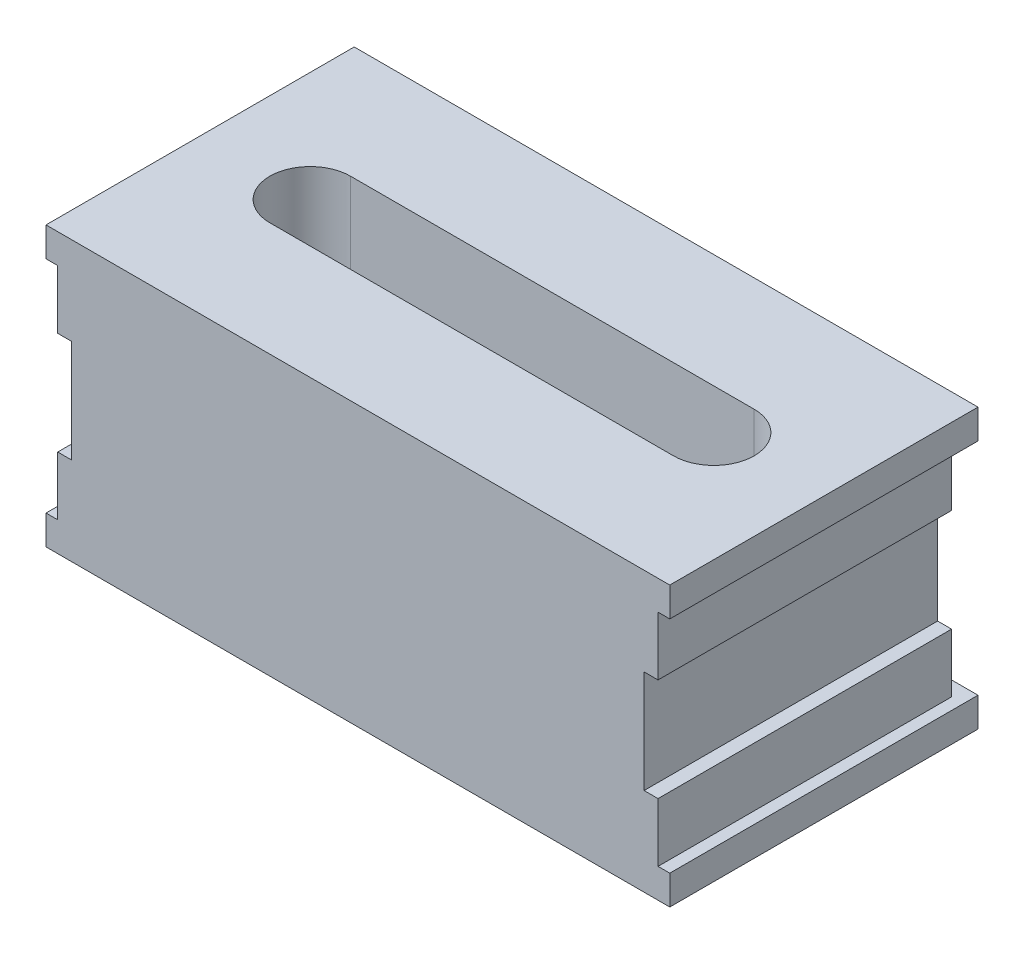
ISO-10303-21;
HEADER;
FILE_DESCRIPTION(('STEP AP214'),'2;1');
FILE_NAME('part.step','',(''),(''),'','','');
FILE_SCHEMA(('AUTOMOTIVE_DESIGN { 1 0 10303 214 1 1 1 1 }'));
ENDSEC;
DATA;
#1=APPLICATION_CONTEXT('core data for automotive mechanical design processes');
#2=APPLICATION_PROTOCOL_DEFINITION('international standard','automotive_design',2000,#1);
#3=PRODUCT_CONTEXT('',#1,'mechanical');
#4=PRODUCT('Part','Part','',(#3));
#5=PRODUCT_RELATED_PRODUCT_CATEGORY('part','',(#4));
#6=PRODUCT_DEFINITION_FORMATION('','',#4);
#7=PRODUCT_DEFINITION_CONTEXT('part definition',#1,'design');
#8=PRODUCT_DEFINITION('design','',#6,#7);
#9=PRODUCT_DEFINITION_SHAPE('','',#8);
#10=(LENGTH_UNIT() NAMED_UNIT(*) SI_UNIT(.MILLI.,.METRE.));
#11=(NAMED_UNIT(*) PLANE_ANGLE_UNIT() SI_UNIT($,.RADIAN.));
#12=(NAMED_UNIT(*) SI_UNIT($,.STERADIAN.) SOLID_ANGLE_UNIT());
#13=UNCERTAINTY_MEASURE_WITH_UNIT(LENGTH_MEASURE(1.E-05),#10,'distance_accuracy_value','');
#14=(GEOMETRIC_REPRESENTATION_CONTEXT(3) GLOBAL_UNCERTAINTY_ASSIGNED_CONTEXT((#13)) GLOBAL_UNIT_ASSIGNED_CONTEXT((#10,
#11,#12)) REPRESENTATION_CONTEXT('',''));
#15=CARTESIAN_POINT('',(0.,0.,0.));
#16=DIRECTION('',(0.,0.,1.));
#17=DIRECTION('',(1.,0.,0.));
#18=AXIS2_PLACEMENT_3D('',#15,#16,#17);
#19=CARTESIAN_POINT('',(-21.25,9.5,10.5));
#20=DIRECTION('',(0.,-1.,0.));
#21=DIRECTION('',(0.,0.,-1.));
#22=AXIS2_PLACEMENT_3D('',#19,#20,#21);
#23=PLANE('',#22);
#24=DIRECTION('',(-1.,0.,0.));
#25=VECTOR('',#24,1.);
#26=CARTESIAN_POINT('',(-21.25,9.5,2.75));
#27=LINE('',#26,#25);
#28=CARTESIAN_POINT('',(13.75,9.5,2.75));
#29=VERTEX_POINT('',#28);
#30=CARTESIAN_POINT('',(-13.75,9.5,2.75));
#31=VERTEX_POINT('',#30);
#32=EDGE_CURVE('E301',#29,#31,#27,.T.);
#33=ORIENTED_EDGE('',*,*,#32,.T.);
#34=CARTESIAN_POINT('',(-13.75,9.5,0.));
#35=DIRECTION('',(0.,-1.,0.));
#36=DIRECTION('',(0.,0.,-1.));
#37=AXIS2_PLACEMENT_3D('',#34,#35,#36);
#38=CIRCLE('',#37,2.75);
#39=CARTESIAN_POINT('',(-13.75,9.5,-2.75));
#40=VERTEX_POINT('',#39);
#41=EDGE_CURVE('E294',#31,#40,#38,.T.);
#42=ORIENTED_EDGE('',*,*,#41,.T.);
#43=DIRECTION('',(1.,0.,0.));
#44=VECTOR('',#43,1.);
#45=CARTESIAN_POINT('',(-21.25,9.5,-2.75));
#46=LINE('',#45,#44);
#47=CARTESIAN_POINT('',(13.75,9.5,-2.75));
#48=VERTEX_POINT('',#47);
#49=EDGE_CURVE('E220',#40,#48,#46,.T.);
#50=ORIENTED_EDGE('',*,*,#49,.T.);
#51=CARTESIAN_POINT('',(13.75,9.5,0.));
#52=DIRECTION('',(0.,-1.,0.));
#53=DIRECTION('',(0.,0.,-1.));
#54=AXIS2_PLACEMENT_3D('',#51,#52,#53);
#55=CIRCLE('',#54,2.75);
#56=EDGE_CURVE('E281',#48,#29,#55,.T.);
#57=ORIENTED_EDGE('',*,*,#56,.T.);
#58=EDGE_LOOP('',(#33,#42,#50,#57));
#59=FACE_BOUND('',#58,.T.);
#60=DIRECTION('',(0.,0.,-1.));
#61=VECTOR('',#60,1.);
#62=CARTESIAN_POINT('',(21.25,9.5,10.5));
#63=LINE('',#62,#61);
#64=CARTESIAN_POINT('',(21.25,9.5,10.5));
#65=VERTEX_POINT('',#64);
#66=CARTESIAN_POINT('',(21.25,9.5,-10.5));
#67=VERTEX_POINT('',#66);
#68=EDGE_CURVE('E9',#65,#67,#63,.T.);
#69=ORIENTED_EDGE('',*,*,#68,.T.);
#70=DIRECTION('',(-1.,0.,0.));
#71=VECTOR('',#70,1.);
#72=CARTESIAN_POINT('',(-21.25,9.5,-10.5));
#73=LINE('',#72,#71);
#74=CARTESIAN_POINT('',(-21.25,9.5,-10.5));
#75=VERTEX_POINT('',#74);
#76=EDGE_CURVE('E226',#67,#75,#73,.T.);
#77=ORIENTED_EDGE('',*,*,#76,.T.);
#78=DIRECTION('',(0.,0.,-1.));
#79=VECTOR('',#78,1.);
#80=CARTESIAN_POINT('',(-21.25,9.5,10.5));
#81=LINE('',#80,#79);
#82=CARTESIAN_POINT('',(-21.25,9.5,10.5));
#83=VERTEX_POINT('',#82);
#84=EDGE_CURVE('E200',#83,#75,#81,.T.);
#85=ORIENTED_EDGE('',*,*,#84,.F.);
#86=DIRECTION('',(-1.,0.,0.));
#87=VECTOR('',#86,1.);
#88=CARTESIAN_POINT('',(-21.25,9.5,10.5));
#89=LINE('',#88,#87);
#90=EDGE_CURVE('E502',#65,#83,#89,.T.);
#91=ORIENTED_EDGE('',*,*,#90,.F.);
#92=EDGE_LOOP('',(#69,#77,#85,#91));
#93=FACE_BOUND('',#92,.T.);
#94=ADVANCED_FACE('F15',(#59,#93),#23,.F.);
#95=CARTESIAN_POINT('',(21.25,9.5,10.5));
#96=DIRECTION('',(-1.,0.,0.));
#97=DIRECTION('',(0.,1.,0.));
#98=AXIS2_PLACEMENT_3D('',#95,#96,#97);
#99=PLANE('',#98);
#100=DIRECTION('',(0.,1.,0.));
#101=VECTOR('',#100,1.);
#102=CARTESIAN_POINT('',(21.25,9.5,-10.5));
#103=LINE('',#102,#101);
#104=CARTESIAN_POINT('',(21.25,-9.5,-10.5));
#105=VERTEX_POINT('',#104);
#106=CARTESIAN_POINT('',(21.25,-7.5,-10.5));
#107=VERTEX_POINT('',#106);
#108=EDGE_CURVE('E24',#105,#107,#103,.T.);
#109=ORIENTED_EDGE('',*,*,#108,.T.);
#110=DIRECTION('',(0.,0.,1.));
#111=VECTOR('',#110,1.);
#112=CARTESIAN_POINT('',(21.25,-7.5,-11.5));
#113=LINE('',#112,#111);
#114=CARTESIAN_POINT('',(21.25,-7.5,10.5));
#115=VERTEX_POINT('',#114);
#116=EDGE_CURVE('E452',#107,#115,#113,.T.);
#117=ORIENTED_EDGE('',*,*,#116,.T.);
#118=DIRECTION('',(0.,1.,0.));
#119=VECTOR('',#118,1.);
#120=CARTESIAN_POINT('',(21.25,9.5,10.5));
#121=LINE('',#120,#119);
#122=CARTESIAN_POINT('',(21.25,-9.5,10.5));
#123=VERTEX_POINT('',#122);
#124=EDGE_CURVE('E206',#123,#115,#121,.T.);
#125=ORIENTED_EDGE('',*,*,#124,.F.);
#126=DIRECTION('',(0.,0.,-1.));
#127=VECTOR('',#126,1.);
#128=CARTESIAN_POINT('',(21.25,-9.5,10.5));
#129=LINE('',#128,#127);
#130=EDGE_CURVE('E203',#123,#105,#129,.T.);
#131=ORIENTED_EDGE('',*,*,#130,.T.);
#132=EDGE_LOOP('',(#109,#117,#125,#131));
#133=FACE_BOUND('',#132,.T.);
#134=ADVANCED_FACE('F204',(#133),#99,.F.);
#135=CARTESIAN_POINT('',(21.25,9.5,10.5));
#136=DIRECTION('',(-1.,0.,0.));
#137=DIRECTION('',(0.,1.,0.));
#138=AXIS2_PLACEMENT_3D('',#135,#136,#137);
#139=PLANE('',#138);
#140=DIRECTION('',(0.,1.,0.));
#141=VECTOR('',#140,1.);
#142=CARTESIAN_POINT('',(21.25,9.5,10.5));
#143=LINE('',#142,#141);
#144=CARTESIAN_POINT('',(21.25,7.5,10.5));
#145=VERTEX_POINT('',#144);
#146=EDGE_CURVE('E508',#145,#65,#143,.T.);
#147=ORIENTED_EDGE('',*,*,#146,.F.);
#148=DIRECTION('',(0.,0.,1.));
#149=VECTOR('',#148,1.);
#150=CARTESIAN_POINT('',(21.25,7.5,-11.5));
#151=LINE('',#150,#149);
#152=CARTESIAN_POINT('',(21.25,7.5,-10.5));
#153=VERTEX_POINT('',#152);
#154=EDGE_CURVE('E266',#153,#145,#151,.T.);
#155=ORIENTED_EDGE('',*,*,#154,.F.);
#156=DIRECTION('',(0.,1.,0.));
#157=VECTOR('',#156,1.);
#158=CARTESIAN_POINT('',(21.25,9.5,-10.5));
#159=LINE('',#158,#157);
#160=EDGE_CURVE('E229',#153,#67,#159,.T.);
#161=ORIENTED_EDGE('',*,*,#160,.T.);
#162=ORIENTED_EDGE('',*,*,#68,.F.);
#163=EDGE_LOOP('',(#147,#155,#161,#162));
#164=FACE_BOUND('',#163,.T.);
#165=ADVANCED_FACE('F335',(#164),#139,.F.);
#166=CARTESIAN_POINT('',(-21.25,-9.5,-10.5));
#167=DIRECTION('',(0.,0.,1.));
#168=DIRECTION('',(1.,0.,0.));
#169=AXIS2_PLACEMENT_3D('',#166,#167,#168);
#170=PLANE('',#169);
#171=DIRECTION('',(0.,-1.,0.));
#172=VECTOR('',#171,1.);
#173=CARTESIAN_POINT('',(-21.25,9.5,-10.5));
#174=LINE('',#173,#172);
#175=CARTESIAN_POINT('',(-21.25,-7.5,-10.5));
#176=VERTEX_POINT('',#175);
#177=CARTESIAN_POINT('',(-21.25,-9.5,-10.5));
#178=VERTEX_POINT('',#177);
#179=EDGE_CURVE('E185',#176,#178,#174,.T.);
#180=ORIENTED_EDGE('',*,*,#179,.F.);
#181=DIRECTION('',(1.,0.,0.));
#182=VECTOR('',#181,1.);
#183=CARTESIAN_POINT('',(-21.25,-7.5,-10.5));
#184=LINE('',#183,#182);
#185=EDGE_CURVE('E196',#176,#107,#184,.T.);
#186=ORIENTED_EDGE('',*,*,#185,.T.);
#187=ORIENTED_EDGE('',*,*,#108,.F.);
#188=DIRECTION('',(1.,0.,0.));
#189=VECTOR('',#188,1.);
#190=CARTESIAN_POINT('',(-21.25,-9.5,-10.5));
#191=LINE('',#190,#189);
#192=EDGE_CURVE('E193',#178,#105,#191,.T.);
#193=ORIENTED_EDGE('',*,*,#192,.F.);
#194=EDGE_LOOP('',(#180,#186,#187,#193));
#195=FACE_BOUND('',#194,.T.);
#196=ADVANCED_FACE('F191',(#195),#170,.F.);
#197=CARTESIAN_POINT('',(-21.25,9.5,10.5));
#198=DIRECTION('',(1.,0.,0.));
#199=DIRECTION('',(0.,1.,0.));
#200=AXIS2_PLACEMENT_3D('',#197,#198,#199);
#201=PLANE('',#200);
#202=DIRECTION('',(0.,0.,1.));
#203=VECTOR('',#202,1.);
#204=CARTESIAN_POINT('',(-21.25,7.5,-11.5));
#205=LINE('',#204,#203);
#206=CARTESIAN_POINT('',(-21.25,7.5,-10.5));
#207=VERTEX_POINT('',#206);
#208=CARTESIAN_POINT('',(-21.25,7.5,10.5));
#209=VERTEX_POINT('',#208);
#210=EDGE_CURVE('E473',#207,#209,#205,.T.);
#211=ORIENTED_EDGE('',*,*,#210,.T.);
#212=DIRECTION('',(0.,-1.,0.));
#213=VECTOR('',#212,1.);
#214=CARTESIAN_POINT('',(-21.25,9.5,10.5));
#215=LINE('',#214,#213);
#216=EDGE_CURVE('E496',#83,#209,#215,.T.);
#217=ORIENTED_EDGE('',*,*,#216,.F.);
#218=ORIENTED_EDGE('',*,*,#84,.T.);
#219=DIRECTION('',(0.,-1.,0.));
#220=VECTOR('',#219,1.);
#221=CARTESIAN_POINT('',(-21.25,9.5,-10.5));
#222=LINE('',#221,#220);
#223=EDGE_CURVE('E211',#75,#207,#222,.T.);
#224=ORIENTED_EDGE('',*,*,#223,.T.);
#225=EDGE_LOOP('',(#211,#217,#218,#224));
#226=FACE_BOUND('',#225,.T.);
#227=ADVANCED_FACE('F344',(#226),#201,.F.);
#228=CARTESIAN_POINT('',(-21.25,9.5,10.5));
#229=DIRECTION('',(1.,0.,0.));
#230=DIRECTION('',(0.,1.,0.));
#231=AXIS2_PLACEMENT_3D('',#228,#229,#230);
#232=PLANE('',#231);
#233=DIRECTION('',(0.,0.,1.));
#234=VECTOR('',#233,1.);
#235=CARTESIAN_POINT('',(-21.25,-7.5,-11.5));
#236=LINE('',#235,#234);
#237=CARTESIAN_POINT('',(-21.25,-7.5,10.5));
#238=VERTEX_POINT('',#237);
#239=EDGE_CURVE('E457',#176,#238,#236,.T.);
#240=ORIENTED_EDGE('',*,*,#239,.F.);
#241=ORIENTED_EDGE('',*,*,#179,.T.);
#242=DIRECTION('',(0.,0.,-1.));
#243=VECTOR('',#242,1.);
#244=CARTESIAN_POINT('',(-21.25,-9.5,10.5));
#245=LINE('',#244,#243);
#246=CARTESIAN_POINT('',(-21.25,-9.5,10.5));
#247=VERTEX_POINT('',#246);
#248=EDGE_CURVE('E214',#247,#178,#245,.T.);
#249=ORIENTED_EDGE('',*,*,#248,.F.);
#250=DIRECTION('',(0.,-1.,0.));
#251=VECTOR('',#250,1.);
#252=CARTESIAN_POINT('',(-21.25,9.5,10.5));
#253=LINE('',#252,#251);
#254=EDGE_CURVE('E535',#238,#247,#253,.T.);
#255=ORIENTED_EDGE('',*,*,#254,.F.);
#256=EDGE_LOOP('',(#240,#241,#249,#255));
#257=FACE_BOUND('',#256,.T.);
#258=ADVANCED_FACE('F345',(#257),#232,.F.);
#259=CARTESIAN_POINT('',(-20.45,-5.5,-11.5));
#260=DIRECTION('',(-1.,0.,0.));
#261=DIRECTION('',(0.,0.,1.));
#262=AXIS2_PLACEMENT_3D('',#259,#260,#261);
#263=PLANE('',#262);
#264=DIRECTION('',(0.,0.,1.));
#265=VECTOR('',#264,1.);
#266=CARTESIAN_POINT('',(-20.45,-3.5,-11.5));
#267=LINE('',#266,#265);
#268=CARTESIAN_POINT('',(-20.45,-3.5,-9.5));
#269=VERTEX_POINT('',#268);
#270=CARTESIAN_POINT('',(-20.45,-3.5,10.5));
#271=VERTEX_POINT('',#270);
#272=EDGE_CURVE('E248',#269,#271,#267,.T.);
#273=ORIENTED_EDGE('',*,*,#272,.F.);
#274=DIRECTION('',(0.,-1.,0.));
#275=VECTOR('',#274,1.);
#276=CARTESIAN_POINT('',(-20.45,-5.5,-9.5));
#277=LINE('',#276,#275);
#278=CARTESIAN_POINT('',(-20.45,-7.5,-9.5));
#279=VERTEX_POINT('',#278);
#280=EDGE_CURVE('E420',#269,#279,#277,.T.);
#281=ORIENTED_EDGE('',*,*,#280,.T.);
#282=DIRECTION('',(0.,0.,1.));
#283=VECTOR('',#282,1.);
#284=CARTESIAN_POINT('',(-20.45,-7.5,-9.5));
#285=LINE('',#284,#283);
#286=CARTESIAN_POINT('',(-20.45,-7.5,10.5));
#287=VERTEX_POINT('',#286);
#288=EDGE_CURVE('E464',#279,#287,#285,.T.);
#289=ORIENTED_EDGE('',*,*,#288,.T.);
#290=DIRECTION('',(0.,-1.,0.));
#291=VECTOR('',#290,1.);
#292=CARTESIAN_POINT('',(-20.45,-5.5,10.5));
#293=LINE('',#292,#291);
#294=EDGE_CURVE('E523',#271,#287,#293,.T.);
#295=ORIENTED_EDGE('',*,*,#294,.F.);
#296=EDGE_LOOP('',(#273,#281,#289,#295));
#297=FACE_BOUND('',#296,.T.);
#298=ADVANCED_FACE('F348',(#297),#263,.T.);
#299=CARTESIAN_POINT('',(-20.45,-3.5,-11.5));
#300=DIRECTION('',(0.,1.,0.));
#301=DIRECTION('',(1.,0.,0.));
#302=AXIS2_PLACEMENT_3D('',#299,#300,#301);
#303=PLANE('',#302);
#304=DIRECTION('',(-1.,0.,0.));
#305=VECTOR('',#304,1.);
#306=CARTESIAN_POINT('',(-20.45,-3.5,10.5));
#307=LINE('',#306,#305);
#308=CARTESIAN_POINT('',(-19.5,-3.5,10.5));
#309=VERTEX_POINT('',#308);
#310=EDGE_CURVE('E519',#309,#271,#307,.T.);
#311=ORIENTED_EDGE('',*,*,#310,.F.);
#312=DIRECTION('',(0.,0.,1.));
#313=VECTOR('',#312,1.);
#314=CARTESIAN_POINT('',(-19.5,-3.5,-10.5));
#315=LINE('',#314,#313);
#316=CARTESIAN_POINT('',(-19.5,-3.5,-9.5));
#317=VERTEX_POINT('',#316);
#318=EDGE_CURVE('E246',#317,#309,#315,.T.);
#319=ORIENTED_EDGE('',*,*,#318,.F.);
#320=DIRECTION('',(-1.,0.,0.));
#321=VECTOR('',#320,1.);
#322=CARTESIAN_POINT('',(-20.45,-3.5,-9.5));
#323=LINE('',#322,#321);
#324=EDGE_CURVE('E424',#317,#269,#323,.T.);
#325=ORIENTED_EDGE('',*,*,#324,.T.);
#326=ORIENTED_EDGE('',*,*,#272,.T.);
#327=EDGE_LOOP('',(#311,#319,#325,#326));
#328=FACE_BOUND('',#327,.T.);
#329=ADVANCED_FACE('F351',(#328),#303,.T.);
#330=CARTESIAN_POINT('',(-19.5,1.75,-11.5));
#331=DIRECTION('',(-1.,0.,0.));
#332=DIRECTION('',(0.,0.,1.));
#333=AXIS2_PLACEMENT_3D('',#330,#331,#332);
#334=PLANE('',#333);
#335=DIRECTION('',(0.,-1.,0.));
#336=VECTOR('',#335,1.);
#337=CARTESIAN_POINT('',(-19.5,1.75,10.5));
#338=LINE('',#337,#336);
#339=CARTESIAN_POINT('',(-19.5,3.5,10.5));
#340=VERTEX_POINT('',#339);
#341=EDGE_CURVE('E512',#340,#309,#338,.T.);
#342=ORIENTED_EDGE('',*,*,#341,.F.);
#343=DIRECTION('',(0.,0.,1.));
#344=VECTOR('',#343,1.);
#345=CARTESIAN_POINT('',(-19.5,3.5,-10.5));
#346=LINE('',#345,#344);
#347=CARTESIAN_POINT('',(-19.5,3.5,-9.5));
#348=VERTEX_POINT('',#347);
#349=EDGE_CURVE('E249',#348,#340,#346,.T.);
#350=ORIENTED_EDGE('',*,*,#349,.F.);
#351=DIRECTION('',(0.,-1.,0.));
#352=VECTOR('',#351,1.);
#353=CARTESIAN_POINT('',(-19.5,1.75,-9.5));
#354=LINE('',#353,#352);
#355=EDGE_CURVE('E427',#348,#317,#354,.T.);
#356=ORIENTED_EDGE('',*,*,#355,.T.);
#357=ORIENTED_EDGE('',*,*,#318,.T.);
#358=EDGE_LOOP('',(#342,#350,#356,#357));
#359=FACE_BOUND('',#358,.T.);
#360=ADVANCED_FACE('F355',(#359),#334,.T.);
#361=CARTESIAN_POINT('',(-20.45,3.5,-11.5));
#362=DIRECTION('',(0.,-1.,0.));
#363=DIRECTION('',(0.,0.,-1.));
#364=AXIS2_PLACEMENT_3D('',#361,#362,#363);
#365=PLANE('',#364);
#366=DIRECTION('',(0.,0.,1.));
#367=VECTOR('',#366,1.);
#368=CARTESIAN_POINT('',(-20.45,3.5,-11.5));
#369=LINE('',#368,#367);
#370=CARTESIAN_POINT('',(-20.45,3.5,-9.5));
#371=VERTEX_POINT('',#370);
#372=CARTESIAN_POINT('',(-20.45,3.5,10.5));
#373=VERTEX_POINT('',#372);
#374=EDGE_CURVE('E245',#371,#373,#369,.T.);
#375=ORIENTED_EDGE('',*,*,#374,.F.);
#376=DIRECTION('',(1.,0.,0.));
#377=VECTOR('',#376,1.);
#378=CARTESIAN_POINT('',(-20.45,3.5,-9.5));
#379=LINE('',#378,#377);
#380=EDGE_CURVE('E430',#371,#348,#379,.T.);
#381=ORIENTED_EDGE('',*,*,#380,.T.);
#382=ORIENTED_EDGE('',*,*,#349,.T.);
#383=DIRECTION('',(1.,0.,0.));
#384=VECTOR('',#383,1.);
#385=CARTESIAN_POINT('',(-20.45,3.5,10.5));
#386=LINE('',#385,#384);
#387=EDGE_CURVE('E559',#373,#340,#386,.T.);
#388=ORIENTED_EDGE('',*,*,#387,.F.);
#389=EDGE_LOOP('',(#375,#381,#382,#388));
#390=FACE_BOUND('',#389,.T.);
#391=ADVANCED_FACE('F358',(#390),#365,.T.);
#392=CARTESIAN_POINT('',(-20.45,5.5,-11.5));
#393=DIRECTION('',(-1.,0.,0.));
#394=DIRECTION('',(0.,0.,1.));
#395=AXIS2_PLACEMENT_3D('',#392,#393,#394);
#396=PLANE('',#395);
#397=DIRECTION('',(0.,-1.,0.));
#398=VECTOR('',#397,1.);
#399=CARTESIAN_POINT('',(-20.45,5.5,10.5));
#400=LINE('',#399,#398);
#401=CARTESIAN_POINT('',(-20.45,7.5,10.5));
#402=VERTEX_POINT('',#401);
#403=EDGE_CURVE('E495',#402,#373,#400,.T.);
#404=ORIENTED_EDGE('',*,*,#403,.F.);
#405=DIRECTION('',(0.,0.,-1.));
#406=VECTOR('',#405,1.);
#407=CARTESIAN_POINT('',(-20.45,7.5,-9.5));
#408=LINE('',#407,#406);
#409=CARTESIAN_POINT('',(-20.45,7.5,-9.5));
#410=VERTEX_POINT('',#409);
#411=EDGE_CURVE('E471',#402,#410,#408,.T.);
#412=ORIENTED_EDGE('',*,*,#411,.T.);
#413=DIRECTION('',(0.,-1.,0.));
#414=VECTOR('',#413,1.);
#415=CARTESIAN_POINT('',(-20.45,5.5,-9.5));
#416=LINE('',#415,#414);
#417=EDGE_CURVE('E435',#410,#371,#416,.T.);
#418=ORIENTED_EDGE('',*,*,#417,.T.);
#419=ORIENTED_EDGE('',*,*,#374,.T.);
#420=EDGE_LOOP('',(#404,#412,#418,#419));
#421=FACE_BOUND('',#420,.T.);
#422=ADVANCED_FACE('F362',(#421),#396,.T.);
#423=CARTESIAN_POINT('',(20.45,5.5,-11.5));
#424=DIRECTION('',(-1.,0.,0.));
#425=DIRECTION('',(0.,0.,1.));
#426=AXIS2_PLACEMENT_3D('',#423,#424,#425);
#427=PLANE('',#426);
#428=DIRECTION('',(0.,-1.,0.));
#429=VECTOR('',#428,1.);
#430=CARTESIAN_POINT('',(20.45,5.5,-9.5));
#431=LINE('',#430,#429);
#432=CARTESIAN_POINT('',(20.45,7.5,-9.5));
#433=VERTEX_POINT('',#432);
#434=CARTESIAN_POINT('',(20.45,3.5,-9.5));
#435=VERTEX_POINT('',#434);
#436=EDGE_CURVE('E443',#433,#435,#431,.T.);
#437=ORIENTED_EDGE('',*,*,#436,.F.);
#438=DIRECTION('',(0.,0.,-1.));
#439=VECTOR('',#438,1.);
#440=CARTESIAN_POINT('',(20.45,7.5,-9.5));
#441=LINE('',#440,#439);
#442=CARTESIAN_POINT('',(20.45,7.5,10.5));
#443=VERTEX_POINT('',#442);
#444=EDGE_CURVE('E468',#443,#433,#441,.T.);
#445=ORIENTED_EDGE('',*,*,#444,.F.);
#446=DIRECTION('',(0.,-1.,0.));
#447=VECTOR('',#446,1.);
#448=CARTESIAN_POINT('',(20.45,5.5,10.5));
#449=LINE('',#448,#447);
#450=CARTESIAN_POINT('',(20.45,3.5,10.5));
#451=VERTEX_POINT('',#450);
#452=EDGE_CURVE('E514',#443,#451,#449,.T.);
#453=ORIENTED_EDGE('',*,*,#452,.T.);
#454=DIRECTION('',(0.,0.,1.));
#455=VECTOR('',#454,1.);
#456=CARTESIAN_POINT('',(20.45,3.5,-11.5));
#457=LINE('',#456,#455);
#458=EDGE_CURVE('E242',#435,#451,#457,.T.);
#459=ORIENTED_EDGE('',*,*,#458,.F.);
#460=EDGE_LOOP('',(#437,#445,#453,#459));
#461=FACE_BOUND('',#460,.T.);
#462=ADVANCED_FACE('F366',(#461),#427,.F.);
#463=CARTESIAN_POINT('',(20.45,3.5,-11.5));
#464=DIRECTION('',(0.,1.,0.));
#465=DIRECTION('',(1.,0.,0.));
#466=AXIS2_PLACEMENT_3D('',#463,#464,#465);
#467=PLANE('',#466);
#468=DIRECTION('',(-1.,0.,0.));
#469=VECTOR('',#468,1.);
#470=CARTESIAN_POINT('',(20.45,3.5,-9.5));
#471=LINE('',#470,#469);
#472=CARTESIAN_POINT('',(19.5,3.5,-9.5));
#473=VERTEX_POINT('',#472);
#474=EDGE_CURVE('E447',#435,#473,#471,.T.);
#475=ORIENTED_EDGE('',*,*,#474,.F.);
#476=ORIENTED_EDGE('',*,*,#458,.T.);
#477=DIRECTION('',(-1.,0.,0.));
#478=VECTOR('',#477,1.);
#479=CARTESIAN_POINT('',(20.45,3.5,10.5));
#480=LINE('',#479,#478);
#481=CARTESIAN_POINT('',(19.5,3.5,10.5));
#482=VERTEX_POINT('',#481);
#483=EDGE_CURVE('E518',#451,#482,#480,.T.);
#484=ORIENTED_EDGE('',*,*,#483,.T.);
#485=DIRECTION('',(0.,0.,1.));
#486=VECTOR('',#485,1.);
#487=CARTESIAN_POINT('',(19.5,3.5,-10.5));
#488=LINE('',#487,#486);
#489=EDGE_CURVE('E238',#473,#482,#488,.T.);
#490=ORIENTED_EDGE('',*,*,#489,.F.);
#491=EDGE_LOOP('',(#475,#476,#484,#490));
#492=FACE_BOUND('',#491,.T.);
#493=ADVANCED_FACE('F370',(#492),#467,.F.);
#494=CARTESIAN_POINT('',(19.5,1.75,-11.5));
#495=DIRECTION('',(-1.,0.,0.));
#496=DIRECTION('',(0.,0.,1.));
#497=AXIS2_PLACEMENT_3D('',#494,#495,#496);
#498=PLANE('',#497);
#499=DIRECTION('',(0.,-1.,0.));
#500=VECTOR('',#499,1.);
#501=CARTESIAN_POINT('',(19.5,1.75,-9.5));
#502=LINE('',#501,#500);
#503=CARTESIAN_POINT('',(19.5,-3.5,-9.5));
#504=VERTEX_POINT('',#503);
#505=EDGE_CURVE('E410',#473,#504,#502,.T.);
#506=ORIENTED_EDGE('',*,*,#505,.F.);
#507=ORIENTED_EDGE('',*,*,#489,.T.);
#508=DIRECTION('',(0.,-1.,0.));
#509=VECTOR('',#508,1.);
#510=CARTESIAN_POINT('',(19.5,1.75,10.5));
#511=LINE('',#510,#509);
#512=CARTESIAN_POINT('',(19.5,-3.5,10.5));
#513=VERTEX_POINT('',#512);
#514=EDGE_CURVE('E568',#482,#513,#511,.T.);
#515=ORIENTED_EDGE('',*,*,#514,.T.);
#516=DIRECTION('',(0.,0.,1.));
#517=VECTOR('',#516,1.);
#518=CARTESIAN_POINT('',(19.5,-3.5,-10.5));
#519=LINE('',#518,#517);
#520=EDGE_CURVE('E234',#504,#513,#519,.T.);
#521=ORIENTED_EDGE('',*,*,#520,.F.);
#522=EDGE_LOOP('',(#506,#507,#515,#521));
#523=FACE_BOUND('',#522,.T.);
#524=ADVANCED_FACE('F374',(#523),#498,.F.);
#525=CARTESIAN_POINT('',(20.45,-3.5,-11.5));
#526=DIRECTION('',(0.,-1.,0.));
#527=DIRECTION('',(0.,0.,-1.));
#528=AXIS2_PLACEMENT_3D('',#525,#526,#527);
#529=PLANE('',#528);
#530=DIRECTION('',(1.,0.,0.));
#531=VECTOR('',#530,1.);
#532=CARTESIAN_POINT('',(20.45,-3.5,-9.5));
#533=LINE('',#532,#531);
#534=CARTESIAN_POINT('',(20.45,-3.5,-9.5));
#535=VERTEX_POINT('',#534);
#536=EDGE_CURVE('E403',#504,#535,#533,.T.);
#537=ORIENTED_EDGE('',*,*,#536,.F.);
#538=ORIENTED_EDGE('',*,*,#520,.T.);
#539=DIRECTION('',(1.,0.,0.));
#540=VECTOR('',#539,1.);
#541=CARTESIAN_POINT('',(20.45,-3.5,10.5));
#542=LINE('',#541,#540);
#543=CARTESIAN_POINT('',(20.45,-3.5,10.5));
#544=VERTEX_POINT('',#543);
#545=EDGE_CURVE('E598',#513,#544,#542,.T.);
#546=ORIENTED_EDGE('',*,*,#545,.T.);
#547=DIRECTION('',(0.,0.,1.));
#548=VECTOR('',#547,1.);
#549=CARTESIAN_POINT('',(20.45,-3.5,-11.5));
#550=LINE('',#549,#548);
#551=EDGE_CURVE('E230',#535,#544,#550,.T.);
#552=ORIENTED_EDGE('',*,*,#551,.F.);
#553=EDGE_LOOP('',(#537,#538,#546,#552));
#554=FACE_BOUND('',#553,.T.);
#555=ADVANCED_FACE('F377',(#554),#529,.F.);
#556=CARTESIAN_POINT('',(20.45,-5.5,-11.5));
#557=DIRECTION('',(-1.,0.,0.));
#558=DIRECTION('',(0.,0.,1.));
#559=AXIS2_PLACEMENT_3D('',#556,#557,#558);
#560=PLANE('',#559);
#561=DIRECTION('',(0.,-1.,0.));
#562=VECTOR('',#561,1.);
#563=CARTESIAN_POINT('',(20.45,-5.5,-9.5));
#564=LINE('',#563,#562);
#565=CARTESIAN_POINT('',(20.45,-7.5,-9.5));
#566=VERTEX_POINT('',#565);
#567=EDGE_CURVE('E392',#535,#566,#564,.T.);
#568=ORIENTED_EDGE('',*,*,#567,.F.);
#569=ORIENTED_EDGE('',*,*,#551,.T.);
#570=DIRECTION('',(0.,-1.,0.));
#571=VECTOR('',#570,1.);
#572=CARTESIAN_POINT('',(20.45,-5.5,10.5));
#573=LINE('',#572,#571);
#574=CARTESIAN_POINT('',(20.45,-7.5,10.5));
#575=VERTEX_POINT('',#574);
#576=EDGE_CURVE('E414',#544,#575,#573,.T.);
#577=ORIENTED_EDGE('',*,*,#576,.T.);
#578=DIRECTION('',(0.,0.,1.));
#579=VECTOR('',#578,1.);
#580=CARTESIAN_POINT('',(20.45,-7.5,-9.5));
#581=LINE('',#580,#579);
#582=EDGE_CURVE('E397',#566,#575,#581,.T.);
#583=ORIENTED_EDGE('',*,*,#582,.F.);
#584=EDGE_LOOP('',(#568,#569,#577,#583));
#585=FACE_BOUND('',#584,.T.);
#586=ADVANCED_FACE('F379',(#585),#560,.F.);
#587=CARTESIAN_POINT('',(-21.25,-9.5,-10.5));
#588=DIRECTION('',(0.,0.,1.));
#589=DIRECTION('',(1.,0.,0.));
#590=AXIS2_PLACEMENT_3D('',#587,#588,#589);
#591=PLANE('',#590);
#592=DIRECTION('',(-1.,0.,0.));
#593=VECTOR('',#592,1.);
#594=CARTESIAN_POINT('',(-21.25,7.5,-10.5));
#595=LINE('',#594,#593);
#596=EDGE_CURVE('E264',#153,#207,#595,.T.);
#597=ORIENTED_EDGE('',*,*,#596,.T.);
#598=ORIENTED_EDGE('',*,*,#223,.F.);
#599=ORIENTED_EDGE('',*,*,#76,.F.);
#600=ORIENTED_EDGE('',*,*,#160,.F.);
#601=EDGE_LOOP('',(#597,#598,#599,#600));
#602=FACE_BOUND('',#601,.T.);
#603=ADVANCED_FACE('F327',(#602),#591,.F.);
#604=CARTESIAN_POINT('',(-21.25,-9.5,10.5));
#605=DIRECTION('',(0.,1.,0.));
#606=DIRECTION('',(1.,0.,0.));
#607=AXIS2_PLACEMENT_3D('',#604,#605,#606);
#608=PLANE('',#607);
#609=DIRECTION('',(-1.,0.,0.));
#610=VECTOR('',#609,1.);
#611=CARTESIAN_POINT('',(-13.75,-9.5,2.75));
#612=LINE('',#611,#610);
#613=CARTESIAN_POINT('',(13.75,-9.5,2.75));
#614=VERTEX_POINT('',#613);
#615=CARTESIAN_POINT('',(-13.75,-9.5,2.75));
#616=VERTEX_POINT('',#615);
#617=EDGE_CURVE('E298',#614,#616,#612,.T.);
#618=ORIENTED_EDGE('',*,*,#617,.F.);
#619=CARTESIAN_POINT('',(13.75,-9.5,0.));
#620=DIRECTION('',(0.,1.,0.));
#621=DIRECTION('',(0.,0.,1.));
#622=AXIS2_PLACEMENT_3D('',#619,#620,#621);
#623=CIRCLE('',#622,2.75);
#624=CARTESIAN_POINT('',(13.75,-9.5,-2.75));
#625=VERTEX_POINT('',#624);
#626=EDGE_CURVE('E272',#614,#625,#623,.T.);
#627=ORIENTED_EDGE('',*,*,#626,.T.);
#628=DIRECTION('',(1.,0.,0.));
#629=VECTOR('',#628,1.);
#630=CARTESIAN_POINT('',(13.75,-9.5,-2.75));
#631=LINE('',#630,#629);
#632=CARTESIAN_POINT('',(-13.75,-9.5,-2.75));
#633=VERTEX_POINT('',#632);
#634=EDGE_CURVE('E303',#633,#625,#631,.T.);
#635=ORIENTED_EDGE('',*,*,#634,.F.);
#636=CARTESIAN_POINT('',(-13.75,-9.5,0.));
#637=DIRECTION('',(0.,-1.,0.));
#638=DIRECTION('',(0.,0.,-1.));
#639=AXIS2_PLACEMENT_3D('',#636,#637,#638);
#640=CIRCLE('',#639,2.75);
#641=EDGE_CURVE('E286',#616,#633,#640,.T.);
#642=ORIENTED_EDGE('',*,*,#641,.F.);
#643=EDGE_LOOP('',(#618,#627,#635,#642));
#644=FACE_BOUND('',#643,.T.);
#645=ORIENTED_EDGE('',*,*,#248,.T.);
#646=ORIENTED_EDGE('',*,*,#192,.T.);
#647=ORIENTED_EDGE('',*,*,#130,.F.);
#648=DIRECTION('',(1.,0.,0.));
#649=VECTOR('',#648,1.);
#650=CARTESIAN_POINT('',(-21.25,-9.5,10.5));
#651=LINE('',#650,#649);
#652=EDGE_CURVE('E532',#247,#123,#651,.T.);
#653=ORIENTED_EDGE('',*,*,#652,.F.);
#654=EDGE_LOOP('',(#645,#646,#647,#653));
#655=FACE_BOUND('',#654,.T.);
#656=ADVANCED_FACE('F213',(#644,#655),#608,.F.);
#657=CARTESIAN_POINT('',(13.75,10.5,-2.75));
#658=DIRECTION('',(0.,0.,-1.));
#659=DIRECTION('',(-1.,0.,0.));
#660=AXIS2_PLACEMENT_3D('',#657,#658,#659);
#661=PLANE('',#660);
#662=DIRECTION('',(0.,-1.,0.));
#663=VECTOR('',#662,1.);
#664=CARTESIAN_POINT('',(-13.75,10.5,-2.75));
#665=LINE('',#664,#663);
#666=EDGE_CURVE('E290',#40,#633,#665,.T.);
#667=ORIENTED_EDGE('',*,*,#666,.T.);
#668=ORIENTED_EDGE('',*,*,#634,.T.);
#669=DIRECTION('',(0.,-1.,0.));
#670=VECTOR('',#669,1.);
#671=CARTESIAN_POINT('',(13.75,10.5,-2.75));
#672=LINE('',#671,#670);
#673=EDGE_CURVE('E268',#48,#625,#672,.T.);
#674=ORIENTED_EDGE('',*,*,#673,.F.);
#675=ORIENTED_EDGE('',*,*,#49,.F.);
#676=EDGE_LOOP('',(#667,#668,#674,#675));
#677=FACE_BOUND('',#676,.T.);
#678=ADVANCED_FACE('F315',(#677),#661,.F.);
#679=CARTESIAN_POINT('',(-13.75,10.5,2.75));
#680=DIRECTION('',(0.,0.,1.));
#681=DIRECTION('',(1.,0.,0.));
#682=AXIS2_PLACEMENT_3D('',#679,#680,#681);
#683=PLANE('',#682);
#684=DIRECTION('',(0.,-1.,0.));
#685=VECTOR('',#684,1.);
#686=CARTESIAN_POINT('',(13.75,10.5,2.75));
#687=LINE('',#686,#685);
#688=EDGE_CURVE('E277',#29,#614,#687,.T.);
#689=ORIENTED_EDGE('',*,*,#688,.T.);
#690=ORIENTED_EDGE('',*,*,#617,.T.);
#691=DIRECTION('',(0.,-1.,0.));
#692=VECTOR('',#691,1.);
#693=CARTESIAN_POINT('',(-13.75,10.5,2.75));
#694=LINE('',#693,#692);
#695=EDGE_CURVE('E285',#31,#616,#694,.T.);
#696=ORIENTED_EDGE('',*,*,#695,.F.);
#697=ORIENTED_EDGE('',*,*,#32,.F.);
#698=EDGE_LOOP('',(#689,#690,#696,#697));
#699=FACE_BOUND('',#698,.T.);
#700=ADVANCED_FACE('F317',(#699),#683,.F.);
#701=CARTESIAN_POINT('',(-13.75,10.5,0.));
#702=DIRECTION('',(0.,-1.,0.));
#703=DIRECTION('',(0.,0.,-1.));
#704=AXIS2_PLACEMENT_3D('',#701,#702,#703);
#705=CYLINDRICAL_SURFACE('',#704,2.75);
#706=ORIENTED_EDGE('',*,*,#695,.T.);
#707=ORIENTED_EDGE('',*,*,#641,.T.);
#708=ORIENTED_EDGE('',*,*,#666,.F.);
#709=ORIENTED_EDGE('',*,*,#41,.F.);
#710=EDGE_LOOP('',(#706,#707,#708,#709));
#711=FACE_BOUND('',#710,.T.);
#712=ADVANCED_FACE('F324',(#711),#705,.F.);
#713=CARTESIAN_POINT('',(13.75,10.5,0.));
#714=DIRECTION('',(0.,-1.,0.));
#715=DIRECTION('',(0.,0.,-1.));
#716=AXIS2_PLACEMENT_3D('',#713,#714,#715);
#717=CYLINDRICAL_SURFACE('',#716,2.75);
#718=ORIENTED_EDGE('',*,*,#673,.T.);
#719=ORIENTED_EDGE('',*,*,#626,.F.);
#720=ORIENTED_EDGE('',*,*,#688,.F.);
#721=ORIENTED_EDGE('',*,*,#56,.F.);
#722=EDGE_LOOP('',(#718,#719,#720,#721));
#723=FACE_BOUND('',#722,.T.);
#724=ADVANCED_FACE('F313',(#723),#717,.F.);
#725=CARTESIAN_POINT('',(21.25,7.5,-11.5));
#726=DIRECTION('',(0.,1.,0.));
#727=DIRECTION('',(1.,0.,0.));
#728=AXIS2_PLACEMENT_3D('',#725,#726,#727);
#729=PLANE('',#728);
#730=ORIENTED_EDGE('',*,*,#444,.T.);
#731=DIRECTION('',(1.,0.,0.));
#732=VECTOR('',#731,1.);
#733=CARTESIAN_POINT('',(21.25,7.5,-9.5));
#734=LINE('',#733,#732);
#735=EDGE_CURVE('E438',#410,#433,#734,.T.);
#736=ORIENTED_EDGE('',*,*,#735,.F.);
#737=ORIENTED_EDGE('',*,*,#411,.F.);
#738=DIRECTION('',(1.,0.,0.));
#739=VECTOR('',#738,1.);
#740=CARTESIAN_POINT('',(-21.25,7.5,10.5));
#741=LINE('',#740,#739);
#742=EDGE_CURVE('E488',#209,#402,#741,.T.);
#743=ORIENTED_EDGE('',*,*,#742,.F.);
#744=ORIENTED_EDGE('',*,*,#210,.F.);
#745=ORIENTED_EDGE('',*,*,#596,.F.);
#746=ORIENTED_EDGE('',*,*,#154,.T.);
#747=DIRECTION('',(-1.,0.,0.));
#748=VECTOR('',#747,1.);
#749=CARTESIAN_POINT('',(21.25,7.5,10.5));
#750=LINE('',#749,#748);
#751=EDGE_CURVE('E517',#145,#443,#750,.T.);
#752=ORIENTED_EDGE('',*,*,#751,.T.);
#753=EDGE_LOOP('',(#730,#736,#737,#743,#744,#745,#746,#752));
#754=FACE_BOUND('',#753,.T.);
#755=ADVANCED_FACE('F485',(#754),#729,.F.);
#756=CARTESIAN_POINT('',(21.25,-7.5,-11.5));
#757=DIRECTION('',(0.,-1.,0.));
#758=DIRECTION('',(0.,0.,-1.));
#759=AXIS2_PLACEMENT_3D('',#756,#757,#758);
#760=PLANE('',#759);
#761=DIRECTION('',(-1.,0.,0.));
#762=VECTOR('',#761,1.);
#763=CARTESIAN_POINT('',(21.25,-7.5,-9.5));
#764=LINE('',#763,#762);
#765=EDGE_CURVE('E402',#566,#279,#764,.T.);
#766=ORIENTED_EDGE('',*,*,#765,.F.);
#767=ORIENTED_EDGE('',*,*,#582,.T.);
#768=DIRECTION('',(1.,0.,0.));
#769=VECTOR('',#768,1.);
#770=CARTESIAN_POINT('',(21.25,-7.5,10.5));
#771=LINE('',#770,#769);
#772=EDGE_CURVE('E538',#575,#115,#771,.T.);
#773=ORIENTED_EDGE('',*,*,#772,.T.);
#774=ORIENTED_EDGE('',*,*,#116,.F.);
#775=ORIENTED_EDGE('',*,*,#185,.F.);
#776=ORIENTED_EDGE('',*,*,#239,.T.);
#777=DIRECTION('',(-1.,0.,0.));
#778=VECTOR('',#777,1.);
#779=CARTESIAN_POINT('',(-21.25,-7.5,10.5));
#780=LINE('',#779,#778);
#781=EDGE_CURVE('E599',#287,#238,#780,.T.);
#782=ORIENTED_EDGE('',*,*,#781,.F.);
#783=ORIENTED_EDGE('',*,*,#288,.F.);
#784=EDGE_LOOP('',(#766,#767,#773,#774,#775,#776,#782,#783));
#785=FACE_BOUND('',#784,.T.);
#786=ADVANCED_FACE('F545',(#785),#760,.F.);
#787=CARTESIAN_POINT('',(21.25,-7.5,-9.5));
#788=DIRECTION('',(0.,0.,-1.));
#789=DIRECTION('',(0.,-1.,0.));
#790=AXIS2_PLACEMENT_3D('',#787,#788,#789);
#791=PLANE('',#790);
#792=ORIENTED_EDGE('',*,*,#505,.T.);
#793=ORIENTED_EDGE('',*,*,#536,.T.);
#794=ORIENTED_EDGE('',*,*,#567,.T.);
#795=ORIENTED_EDGE('',*,*,#765,.T.);
#796=ORIENTED_EDGE('',*,*,#280,.F.);
#797=ORIENTED_EDGE('',*,*,#324,.F.);
#798=ORIENTED_EDGE('',*,*,#355,.F.);
#799=ORIENTED_EDGE('',*,*,#380,.F.);
#800=ORIENTED_EDGE('',*,*,#417,.F.);
#801=ORIENTED_EDGE('',*,*,#735,.T.);
#802=ORIENTED_EDGE('',*,*,#436,.T.);
#803=ORIENTED_EDGE('',*,*,#474,.T.);
#804=EDGE_LOOP('',(#792,#793,#794,#795,#796,#797,#798,#799,#800,#801,#802,#803));
#805=FACE_BOUND('',#804,.T.);
#806=ADVANCED_FACE('F407',(#805),#791,.T.);
#807=CARTESIAN_POINT('',(-21.25,-9.5,10.5));
#808=DIRECTION('',(0.,0.,1.));
#809=DIRECTION('',(1.,0.,0.));
#810=AXIS2_PLACEMENT_3D('',#807,#808,#809);
#811=PLANE('',#810);
#812=ORIENTED_EDGE('',*,*,#545,.F.);
#813=ORIENTED_EDGE('',*,*,#514,.F.);
#814=ORIENTED_EDGE('',*,*,#483,.F.);
#815=ORIENTED_EDGE('',*,*,#452,.F.);
#816=ORIENTED_EDGE('',*,*,#751,.F.);
#817=ORIENTED_EDGE('',*,*,#146,.T.);
#818=ORIENTED_EDGE('',*,*,#90,.T.);
#819=ORIENTED_EDGE('',*,*,#216,.T.);
#820=ORIENTED_EDGE('',*,*,#742,.T.);
#821=ORIENTED_EDGE('',*,*,#403,.T.);
#822=ORIENTED_EDGE('',*,*,#387,.T.);
#823=ORIENTED_EDGE('',*,*,#341,.T.);
#824=ORIENTED_EDGE('',*,*,#310,.T.);
#825=ORIENTED_EDGE('',*,*,#294,.T.);
#826=ORIENTED_EDGE('',*,*,#781,.T.);
#827=ORIENTED_EDGE('',*,*,#254,.T.);
#828=ORIENTED_EDGE('',*,*,#652,.T.);
#829=ORIENTED_EDGE('',*,*,#124,.T.);
#830=ORIENTED_EDGE('',*,*,#772,.F.);
#831=ORIENTED_EDGE('',*,*,#576,.F.);
#832=EDGE_LOOP('',(#812,#813,#814,#815,#816,#817,#818,#819,#820,#821,#822,#823,#824,#825,#826,
#827,#828,#829,#830,#831));
#833=FACE_BOUND('',#832,.T.);
#834=ADVANCED_FACE('F500',(#833),#811,.T.);
#835=CLOSED_SHELL('',(#94,#134,#165,#196,#227,#258,#298,#329,#360,#391,#422,#462,#493,#524,#555,
#586,#603,#656,#678,#700,#712,#724,#755,#786,#806,#834));
#836=MANIFOLD_SOLID_BREP('B1',#835);
#837=ADVANCED_BREP_SHAPE_REPRESENTATION('',(#18,#836),#14);
#838=SHAPE_DEFINITION_REPRESENTATION(#9,#837);
ENDSEC;
END-ISO-10303-21;
